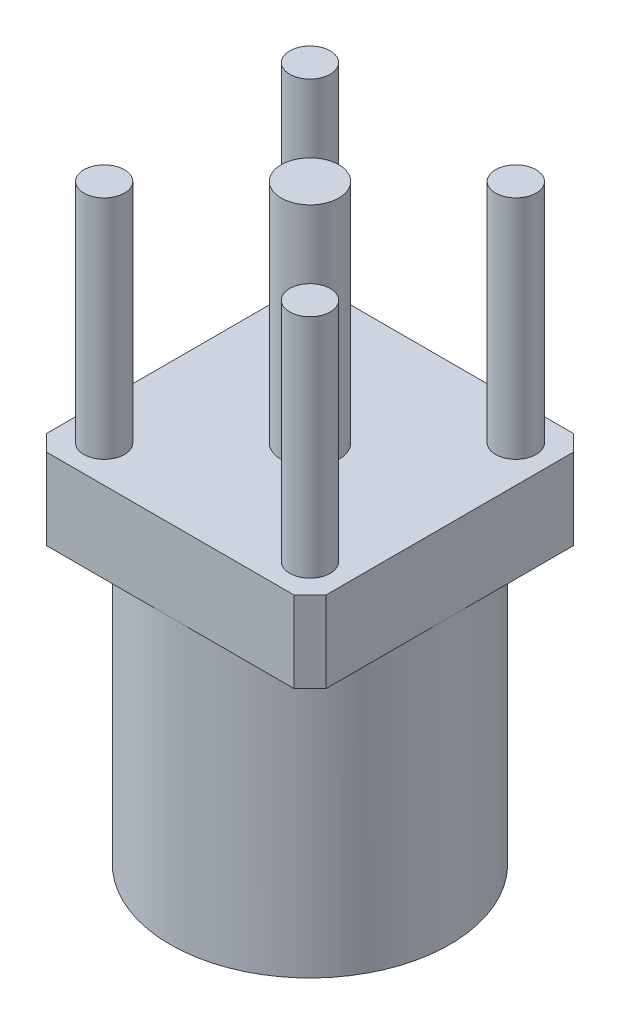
ISO-10303-21;
HEADER;
FILE_DESCRIPTION(('STEP AP214'),'2;1');
FILE_NAME('part.step','',(''),(''),'','','');
FILE_SCHEMA(('AUTOMOTIVE_DESIGN { 1 0 10303 214 1 1 1 1 }'));
ENDSEC;
DATA;
#1=APPLICATION_CONTEXT('core data for automotive mechanical design processes');
#2=APPLICATION_PROTOCOL_DEFINITION('international standard','automotive_design',2000,#1);
#3=PRODUCT_CONTEXT('',#1,'mechanical');
#4=PRODUCT('Part','Part','',(#3));
#5=PRODUCT_RELATED_PRODUCT_CATEGORY('part','',(#4));
#6=PRODUCT_DEFINITION_FORMATION('','',#4);
#7=PRODUCT_DEFINITION_CONTEXT('part definition',#1,'design');
#8=PRODUCT_DEFINITION('design','',#6,#7);
#9=PRODUCT_DEFINITION_SHAPE('','',#8);
#10=(LENGTH_UNIT() NAMED_UNIT(*) SI_UNIT(.MILLI.,.METRE.));
#11=(NAMED_UNIT(*) PLANE_ANGLE_UNIT() SI_UNIT($,.RADIAN.));
#12=(NAMED_UNIT(*) SI_UNIT($,.STERADIAN.) SOLID_ANGLE_UNIT());
#13=UNCERTAINTY_MEASURE_WITH_UNIT(LENGTH_MEASURE(1.E-05),#10,'distance_accuracy_value','');
#14=(GEOMETRIC_REPRESENTATION_CONTEXT(3) GLOBAL_UNCERTAINTY_ASSIGNED_CONTEXT((#13)) GLOBAL_UNIT_ASSIGNED_CONTEXT((#10,
#11,#12)) REPRESENTATION_CONTEXT('',''));
#15=CARTESIAN_POINT('',(0.,0.,0.));
#16=DIRECTION('',(0.,0.,1.));
#17=DIRECTION('',(1.,0.,0.));
#18=AXIS2_PLACEMENT_3D('',#15,#16,#17);
#19=CARTESIAN_POINT('',(0.,-3.5,0.));
#20=DIRECTION('',(0.,1.,0.));
#21=DIRECTION('',(0.,0.,1.));
#22=AXIS2_PLACEMENT_3D('',#19,#20,#21);
#23=CYLINDRICAL_SURFACE('',#22,0.35);
#24=CARTESIAN_POINT('',(0.,0.,0.));
#25=DIRECTION('',(0.,1.,0.));
#26=DIRECTION('',(0.,0.,1.));
#27=AXIS2_PLACEMENT_3D('',#24,#25,#26);
#28=CIRCLE('',#27,0.35);
#29=CARTESIAN_POINT('',(0.,0.,0.35));
#30=VERTEX_POINT('',#29);
#31=EDGE_CURVE('E14',#30,#30,#28,.F.);
#32=ORIENTED_EDGE('',*,*,#31,.T.);
#33=EDGE_LOOP('',(#32));
#34=FACE_BOUND('',#33,.T.);
#35=CARTESIAN_POINT('',(0.,-2.484,0.));
#36=DIRECTION('',(0.,-1.,0.));
#37=DIRECTION('',(0.,0.,-1.));
#38=AXIS2_PLACEMENT_3D('',#35,#36,#37);
#39=CIRCLE('',#38,0.35);
#40=CARTESIAN_POINT('',(0.,-2.484,-0.35));
#41=VERTEX_POINT('',#40);
#42=EDGE_CURVE('E263',#41,#41,#39,.T.);
#43=ORIENTED_EDGE('',*,*,#42,.F.);
#44=EDGE_LOOP('',(#43));
#45=FACE_BOUND('',#44,.T.);
#46=ADVANCED_FACE('F52',(#34,#45),#23,.T.);
#47=CARTESIAN_POINT('',(0.,1.,0.));
#48=DIRECTION('',(0.,1.,0.));
#49=DIRECTION('',(0.,0.,1.));
#50=AXIS2_PLACEMENT_3D('',#47,#48,#49);
#51=PLANE('',#50);
#52=CARTESIAN_POINT('',(1.27,1.,1.27));
#53=DIRECTION('',(0.,1.,0.));
#54=DIRECTION('',(0.,0.,1.));
#55=AXIS2_PLACEMENT_3D('',#52,#53,#54);
#56=CIRCLE('',#55,0.25);
#57=CARTESIAN_POINT('',(1.27,1.,1.52));
#58=VERTEX_POINT('',#57);
#59=EDGE_CURVE('E254',#58,#58,#56,.T.);
#60=ORIENTED_EDGE('',*,*,#59,.F.);
#61=EDGE_LOOP('',(#60));
#62=FACE_BOUND('',#61,.T.);
#63=CARTESIAN_POINT('',(-1.27,1.,1.27));
#64=DIRECTION('',(0.,1.,0.));
#65=DIRECTION('',(0.,0.,1.));
#66=AXIS2_PLACEMENT_3D('',#63,#64,#65);
#67=CIRCLE('',#66,0.25);
#68=CARTESIAN_POINT('',(-1.27,1.,1.52));
#69=VERTEX_POINT('',#68);
#70=EDGE_CURVE('E242',#69,#69,#67,.T.);
#71=ORIENTED_EDGE('',*,*,#70,.F.);
#72=EDGE_LOOP('',(#71));
#73=FACE_BOUND('',#72,.T.);
#74=DIRECTION('',(1.,0.,0.));
#75=VECTOR('',#74,1.);
#76=CARTESIAN_POINT('',(-1.525,1.,1.725));
#77=LINE('',#76,#75);
#78=CARTESIAN_POINT('',(-1.525,1.,1.725));
#79=VERTEX_POINT('',#78);
#80=CARTESIAN_POINT('',(1.525,1.,1.725));
#81=VERTEX_POINT('',#80);
#82=EDGE_CURVE('E166',#79,#81,#77,.T.);
#83=ORIENTED_EDGE('',*,*,#82,.T.);
#84=DIRECTION('',(0.707106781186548,0.,-0.707106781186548));
#85=VECTOR('',#84,1.);
#86=CARTESIAN_POINT('',(1.525,1.,1.725));
#87=LINE('',#86,#85);
#88=CARTESIAN_POINT('',(1.725,1.,1.525));
#89=VERTEX_POINT('',#88);
#90=EDGE_CURVE('E169',#81,#89,#87,.T.);
#91=ORIENTED_EDGE('',*,*,#90,.T.);
#92=DIRECTION('',(0.,0.,-1.));
#93=VECTOR('',#92,1.);
#94=CARTESIAN_POINT('',(1.725,1.,1.525));
#95=LINE('',#94,#93);
#96=CARTESIAN_POINT('',(1.725,1.,-1.525));
#97=VERTEX_POINT('',#96);
#98=EDGE_CURVE('E172',#89,#97,#95,.T.);
#99=ORIENTED_EDGE('',*,*,#98,.T.);
#100=DIRECTION('',(-0.707106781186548,0.,-0.707106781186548));
#101=VECTOR('',#100,1.);
#102=CARTESIAN_POINT('',(1.525,1.,-1.725));
#103=LINE('',#102,#101);
#104=CARTESIAN_POINT('',(1.525,1.,-1.725));
#105=VERTEX_POINT('',#104);
#106=EDGE_CURVE('E174',#97,#105,#103,.T.);
#107=ORIENTED_EDGE('',*,*,#106,.T.);
#108=DIRECTION('',(-1.,0.,0.));
#109=VECTOR('',#108,1.);
#110=CARTESIAN_POINT('',(-1.525,1.,-1.725));
#111=LINE('',#110,#109);
#112=CARTESIAN_POINT('',(-1.525,1.,-1.725));
#113=VERTEX_POINT('',#112);
#114=EDGE_CURVE('E176',#105,#113,#111,.T.);
#115=ORIENTED_EDGE('',*,*,#114,.T.);
#116=DIRECTION('',(-0.707106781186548,0.,0.707106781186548));
#117=VECTOR('',#116,1.);
#118=CARTESIAN_POINT('',(-1.725,1.,-1.525));
#119=LINE('',#118,#117);
#120=CARTESIAN_POINT('',(-1.725,1.,-1.525));
#121=VERTEX_POINT('',#120);
#122=EDGE_CURVE('E178',#113,#121,#119,.T.);
#123=ORIENTED_EDGE('',*,*,#122,.T.);
#124=DIRECTION('',(0.,0.,1.));
#125=VECTOR('',#124,1.);
#126=CARTESIAN_POINT('',(-1.725,1.,1.525));
#127=LINE('',#126,#125);
#128=CARTESIAN_POINT('',(-1.725,1.,1.525));
#129=VERTEX_POINT('',#128);
#130=EDGE_CURVE('E180',#121,#129,#127,.T.);
#131=ORIENTED_EDGE('',*,*,#130,.T.);
#132=DIRECTION('',(0.707106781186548,0.,0.707106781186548));
#133=VECTOR('',#132,1.);
#134=CARTESIAN_POINT('',(-1.725,1.,1.525));
#135=LINE('',#134,#133);
#136=EDGE_CURVE('E182',#129,#79,#135,.T.);
#137=ORIENTED_EDGE('',*,*,#136,.T.);
#138=EDGE_LOOP('',(#83,#91,#99,#107,#115,#123,#131,#137));
#139=FACE_BOUND('',#138,.T.);
#140=CARTESIAN_POINT('',(-1.27,1.,-1.27));
#141=DIRECTION('',(0.,1.,0.));
#142=DIRECTION('',(0.,0.,1.));
#143=AXIS2_PLACEMENT_3D('',#140,#141,#142);
#144=CIRCLE('',#143,0.25);
#145=CARTESIAN_POINT('',(-1.27,1.,-1.02));
#146=VERTEX_POINT('',#145);
#147=EDGE_CURVE('E235',#146,#146,#144,.T.);
#148=ORIENTED_EDGE('',*,*,#147,.F.);
#149=EDGE_LOOP('',(#148));
#150=FACE_BOUND('',#149,.T.);
#151=CARTESIAN_POINT('',(1.27,1.,-1.27));
#152=DIRECTION('',(0.,1.,0.));
#153=DIRECTION('',(0.,0.,1.));
#154=AXIS2_PLACEMENT_3D('',#151,#152,#153);
#155=CIRCLE('',#154,0.25);
#156=CARTESIAN_POINT('',(1.27,1.,-1.02));
#157=VERTEX_POINT('',#156);
#158=EDGE_CURVE('E248',#157,#157,#155,.T.);
#159=ORIENTED_EDGE('',*,*,#158,.F.);
#160=EDGE_LOOP('',(#159));
#161=FACE_BOUND('',#160,.T.);
#162=CARTESIAN_POINT('',(0.,1.,0.));
#163=DIRECTION('',(0.,1.,0.));
#164=DIRECTION('',(0.,0.,1.));
#165=AXIS2_PLACEMENT_3D('',#162,#163,#164);
#166=CIRCLE('',#165,0.3556);
#167=CARTESIAN_POINT('',(0.,1.,0.3556));
#168=VERTEX_POINT('',#167);
#169=EDGE_CURVE('E260',#168,#168,#166,.T.);
#170=ORIENTED_EDGE('',*,*,#169,.F.);
#171=EDGE_LOOP('',(#170));
#172=FACE_BOUND('',#171,.T.);
#173=ADVANCED_FACE('F272',(#62,#73,#139,#150,#161,#172),#51,.T.);
#174=CARTESIAN_POINT('',(0.,0.,0.));
#175=DIRECTION('',(0.,1.,0.));
#176=DIRECTION('',(0.,0.,1.));
#177=AXIS2_PLACEMENT_3D('',#174,#175,#176);
#178=PLANE('',#177);
#179=CARTESIAN_POINT('',(0.,0.,0.));
#180=DIRECTION('',(0.,-1.,0.));
#181=DIRECTION('',(0.,0.,-1.));
#182=AXIS2_PLACEMENT_3D('',#179,#180,#181);
#183=CIRCLE('',#182,1.37499999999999);
#184=CARTESIAN_POINT('',(0.,0.,-1.37499999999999));
#185=VERTEX_POINT('',#184);
#186=EDGE_CURVE('E155',#185,#185,#183,.T.);
#187=ORIENTED_EDGE('',*,*,#186,.T.);
#188=EDGE_LOOP('',(#187));
#189=FACE_BOUND('',#188,.T.);
#190=ORIENTED_EDGE('',*,*,#31,.F.);
#191=EDGE_LOOP('',(#190));
#192=FACE_BOUND('',#191,.T.);
#193=ADVANCED_FACE('F278',(#189,#192),#178,.F.);
#194=CARTESIAN_POINT('',(0.,0.,0.));
#195=DIRECTION('',(0.,-1.,0.));
#196=DIRECTION('',(0.,0.,-1.));
#197=AXIS2_PLACEMENT_3D('',#194,#195,#196);
#198=CIRCLE('',#197,1.725);
#199=CARTESIAN_POINT('',(0.,0.,-1.725));
#200=VERTEX_POINT('',#199);
#201=CARTESIAN_POINT('',(1.725,0.,0.));
#202=VERTEX_POINT('',#201);
#203=EDGE_CURVE('E149',#200,#202,#198,.T.);
#204=ORIENTED_EDGE('',*,*,#203,.F.);
#205=DIRECTION('',(-1.,0.,0.));
#206=VECTOR('',#205,1.);
#207=CARTESIAN_POINT('',(-1.525,0.,-1.725));
#208=LINE('',#207,#206);
#209=CARTESIAN_POINT('',(1.525,0.,-1.725));
#210=VERTEX_POINT('',#209);
#211=EDGE_CURVE('E132',#210,#200,#208,.T.);
#212=ORIENTED_EDGE('',*,*,#211,.F.);
#213=DIRECTION('',(-0.707106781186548,0.,-0.707106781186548));
#214=VECTOR('',#213,1.);
#215=CARTESIAN_POINT('',(1.525,0.,-1.725));
#216=LINE('',#215,#214);
#217=CARTESIAN_POINT('',(1.725,0.,-1.525));
#218=VERTEX_POINT('',#217);
#219=EDGE_CURVE('E147',#218,#210,#216,.T.);
#220=ORIENTED_EDGE('',*,*,#219,.F.);
#221=DIRECTION('',(0.,0.,-1.));
#222=VECTOR('',#221,1.);
#223=CARTESIAN_POINT('',(1.725,0.,1.525));
#224=LINE('',#223,#222);
#225=EDGE_CURVE('E151',#202,#218,#224,.T.);
#226=ORIENTED_EDGE('',*,*,#225,.F.);
#227=EDGE_LOOP('',(#204,#212,#220,#226));
#228=FACE_BOUND('',#227,.T.);
#229=ADVANCED_FACE('F150',(#228),#178,.F.);
#230=CARTESIAN_POINT('',(0.,0.,1.725));
#231=VERTEX_POINT('',#230);
#232=EDGE_CURVE('E60',#202,#231,#198,.T.);
#233=ORIENTED_EDGE('',*,*,#232,.F.);
#234=CARTESIAN_POINT('',(1.725,0.,1.525));
#235=VERTEX_POINT('',#234);
#236=EDGE_CURVE('E191',#235,#202,#224,.T.);
#237=ORIENTED_EDGE('',*,*,#236,.F.);
#238=DIRECTION('',(0.707106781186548,0.,-0.707106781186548));
#239=VECTOR('',#238,1.);
#240=CARTESIAN_POINT('',(1.525,0.,1.725));
#241=LINE('',#240,#239);
#242=CARTESIAN_POINT('',(1.525,0.,1.725));
#243=VERTEX_POINT('',#242);
#244=EDGE_CURVE('E188',#243,#235,#241,.T.);
#245=ORIENTED_EDGE('',*,*,#244,.F.);
#246=DIRECTION('',(1.,0.,0.));
#247=VECTOR('',#246,1.);
#248=CARTESIAN_POINT('',(-1.525,0.,1.725));
#249=LINE('',#248,#247);
#250=EDGE_CURVE('E189',#231,#243,#249,.T.);
#251=ORIENTED_EDGE('',*,*,#250,.F.);
#252=EDGE_LOOP('',(#233,#237,#245,#251));
#253=FACE_BOUND('',#252,.T.);
#254=ADVANCED_FACE('F222',(#253),#178,.F.);
#255=CARTESIAN_POINT('',(-1.725,0.,0.));
#256=VERTEX_POINT('',#255);
#257=EDGE_CURVE('E159',#231,#256,#198,.T.);
#258=ORIENTED_EDGE('',*,*,#257,.F.);
#259=CARTESIAN_POINT('',(-1.525,0.,1.725));
#260=VERTEX_POINT('',#259);
#261=EDGE_CURVE('E185',#260,#231,#249,.T.);
#262=ORIENTED_EDGE('',*,*,#261,.F.);
#263=DIRECTION('',(0.707106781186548,0.,0.707106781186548));
#264=VECTOR('',#263,1.);
#265=CARTESIAN_POINT('',(-1.725,0.,1.525));
#266=LINE('',#265,#264);
#267=CARTESIAN_POINT('',(-1.725,0.,1.525));
#268=VERTEX_POINT('',#267);
#269=EDGE_CURVE('E170',#268,#260,#266,.T.);
#270=ORIENTED_EDGE('',*,*,#269,.F.);
#271=DIRECTION('',(0.,0.,1.));
#272=VECTOR('',#271,1.);
#273=CARTESIAN_POINT('',(-1.725,0.,1.525));
#274=LINE('',#273,#272);
#275=EDGE_CURVE('E195',#256,#268,#274,.T.);
#276=ORIENTED_EDGE('',*,*,#275,.F.);
#277=EDGE_LOOP('',(#258,#262,#270,#276));
#278=FACE_BOUND('',#277,.T.);
#279=ADVANCED_FACE('F325',(#278),#178,.F.);
#280=EDGE_CURVE('E74',#256,#200,#198,.T.);
#281=ORIENTED_EDGE('',*,*,#280,.F.);
#282=CARTESIAN_POINT('',(-1.725,0.,-1.525));
#283=VERTEX_POINT('',#282);
#284=EDGE_CURVE('E196',#283,#256,#274,.T.);
#285=ORIENTED_EDGE('',*,*,#284,.F.);
#286=DIRECTION('',(-0.707106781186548,0.,0.707106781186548));
#287=VECTOR('',#286,1.);
#288=CARTESIAN_POINT('',(-1.725,0.,-1.525));
#289=LINE('',#288,#287);
#290=CARTESIAN_POINT('',(-1.525,0.,-1.725));
#291=VERTEX_POINT('',#290);
#292=EDGE_CURVE('E143',#291,#283,#289,.T.);
#293=ORIENTED_EDGE('',*,*,#292,.F.);
#294=EDGE_CURVE('E135',#200,#291,#208,.T.);
#295=ORIENTED_EDGE('',*,*,#294,.F.);
#296=EDGE_LOOP('',(#281,#285,#293,#295));
#297=FACE_BOUND('',#296,.T.);
#298=ADVANCED_FACE('F146',(#297),#178,.F.);
#299=CARTESIAN_POINT('',(-1.525,1.,1.725));
#300=DIRECTION('',(0.,0.,-1.));
#301=DIRECTION('',(-1.,0.,0.));
#302=AXIS2_PLACEMENT_3D('',#299,#300,#301);
#303=PLANE('',#302);
#304=ORIENTED_EDGE('',*,*,#261,.T.);
#305=ORIENTED_EDGE('',*,*,#250,.T.);
#306=DIRECTION('',(0.,-1.,0.));
#307=VECTOR('',#306,1.);
#308=CARTESIAN_POINT('',(1.525,1.,1.725));
#309=LINE('',#308,#307);
#310=EDGE_CURVE('E160',#81,#243,#309,.T.);
#311=ORIENTED_EDGE('',*,*,#310,.F.);
#312=ORIENTED_EDGE('',*,*,#82,.F.);
#313=DIRECTION('',(0.,-1.,0.));
#314=VECTOR('',#313,1.);
#315=CARTESIAN_POINT('',(-1.525,1.,1.725));
#316=LINE('',#315,#314);
#317=EDGE_CURVE('E184',#79,#260,#316,.T.);
#318=ORIENTED_EDGE('',*,*,#317,.T.);
#319=EDGE_LOOP('',(#304,#305,#311,#312,#318));
#320=FACE_BOUND('',#319,.T.);
#321=ADVANCED_FACE('F54',(#320),#303,.F.);
#322=CARTESIAN_POINT('',(1.525,1.,1.725));
#323=DIRECTION('',(-0.707106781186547,0.,-0.707106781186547));
#324=DIRECTION('',(-0.707106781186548,0.,0.707106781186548));
#325=AXIS2_PLACEMENT_3D('',#322,#323,#324);
#326=PLANE('',#325);
#327=ORIENTED_EDGE('',*,*,#244,.T.);
#328=DIRECTION('',(0.,-1.,0.));
#329=VECTOR('',#328,1.);
#330=CARTESIAN_POINT('',(1.725,1.,1.525));
#331=LINE('',#330,#329);
#332=EDGE_CURVE('E162',#89,#235,#331,.T.);
#333=ORIENTED_EDGE('',*,*,#332,.F.);
#334=ORIENTED_EDGE('',*,*,#90,.F.);
#335=ORIENTED_EDGE('',*,*,#310,.T.);
#336=EDGE_LOOP('',(#327,#333,#334,#335));
#337=FACE_BOUND('',#336,.T.);
#338=ADVANCED_FACE('F224',(#337),#326,.F.);
#339=CARTESIAN_POINT('',(1.725,1.,1.525));
#340=DIRECTION('',(-1.,0.,0.));
#341=DIRECTION('',(0.,0.,1.));
#342=AXIS2_PLACEMENT_3D('',#339,#340,#341);
#343=PLANE('',#342);
#344=ORIENTED_EDGE('',*,*,#236,.T.);
#345=ORIENTED_EDGE('',*,*,#225,.T.);
#346=DIRECTION('',(0.,-1.,0.));
#347=VECTOR('',#346,1.);
#348=CARTESIAN_POINT('',(1.725,1.,-1.525));
#349=LINE('',#348,#347);
#350=EDGE_CURVE('E211',#97,#218,#349,.T.);
#351=ORIENTED_EDGE('',*,*,#350,.F.);
#352=ORIENTED_EDGE('',*,*,#98,.F.);
#353=ORIENTED_EDGE('',*,*,#332,.T.);
#354=EDGE_LOOP('',(#344,#345,#351,#352,#353));
#355=FACE_BOUND('',#354,.T.);
#356=ADVANCED_FACE('F218',(#355),#343,.F.);
#357=CARTESIAN_POINT('',(1.525,1.,-1.725));
#358=DIRECTION('',(-0.707106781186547,0.,0.707106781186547));
#359=DIRECTION('',(0.707106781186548,0.,0.707106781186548));
#360=AXIS2_PLACEMENT_3D('',#357,#358,#359);
#361=PLANE('',#360);
#362=ORIENTED_EDGE('',*,*,#219,.T.);
#363=DIRECTION('',(0.,-1.,0.));
#364=VECTOR('',#363,1.);
#365=CARTESIAN_POINT('',(1.525,1.,-1.725));
#366=LINE('',#365,#364);
#367=EDGE_CURVE('E139',#105,#210,#366,.T.);
#368=ORIENTED_EDGE('',*,*,#367,.F.);
#369=ORIENTED_EDGE('',*,*,#106,.F.);
#370=ORIENTED_EDGE('',*,*,#350,.T.);
#371=EDGE_LOOP('',(#362,#368,#369,#370));
#372=FACE_BOUND('',#371,.T.);
#373=ADVANCED_FACE('F313',(#372),#361,.F.);
#374=CARTESIAN_POINT('',(-1.525,1.,-1.725));
#375=DIRECTION('',(0.,0.,1.));
#376=DIRECTION('',(1.,0.,0.));
#377=AXIS2_PLACEMENT_3D('',#374,#375,#376);
#378=PLANE('',#377);
#379=ORIENTED_EDGE('',*,*,#211,.T.);
#380=ORIENTED_EDGE('',*,*,#294,.T.);
#381=DIRECTION('',(0.,-1.,0.));
#382=VECTOR('',#381,1.);
#383=CARTESIAN_POINT('',(-1.525,1.,-1.725));
#384=LINE('',#383,#382);
#385=EDGE_CURVE('E208',#113,#291,#384,.T.);
#386=ORIENTED_EDGE('',*,*,#385,.F.);
#387=ORIENTED_EDGE('',*,*,#114,.F.);
#388=ORIENTED_EDGE('',*,*,#367,.T.);
#389=EDGE_LOOP('',(#379,#380,#386,#387,#388));
#390=FACE_BOUND('',#389,.T.);
#391=ADVANCED_FACE('F133',(#390),#378,.F.);
#392=CARTESIAN_POINT('',(-1.725,1.,-1.525));
#393=DIRECTION('',(0.707106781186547,0.,0.707106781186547));
#394=DIRECTION('',(0.707106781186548,0.,-0.707106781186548));
#395=AXIS2_PLACEMENT_3D('',#392,#393,#394);
#396=PLANE('',#395);
#397=ORIENTED_EDGE('',*,*,#292,.T.);
#398=DIRECTION('',(0.,-1.,0.));
#399=VECTOR('',#398,1.);
#400=CARTESIAN_POINT('',(-1.725,1.,-1.525));
#401=LINE('',#400,#399);
#402=EDGE_CURVE('E205',#121,#283,#401,.T.);
#403=ORIENTED_EDGE('',*,*,#402,.F.);
#404=ORIENTED_EDGE('',*,*,#122,.F.);
#405=ORIENTED_EDGE('',*,*,#385,.T.);
#406=EDGE_LOOP('',(#397,#403,#404,#405));
#407=FACE_BOUND('',#406,.T.);
#408=ADVANCED_FACE('F306',(#407),#396,.F.);
#409=CARTESIAN_POINT('',(-1.725,1.,1.525));
#410=DIRECTION('',(1.,0.,0.));
#411=DIRECTION('',(0.,0.,-1.));
#412=AXIS2_PLACEMENT_3D('',#409,#410,#411);
#413=PLANE('',#412);
#414=ORIENTED_EDGE('',*,*,#284,.T.);
#415=ORIENTED_EDGE('',*,*,#275,.T.);
#416=DIRECTION('',(0.,-1.,0.));
#417=VECTOR('',#416,1.);
#418=CARTESIAN_POINT('',(-1.725,1.,1.525));
#419=LINE('',#418,#417);
#420=EDGE_CURVE('E202',#129,#268,#419,.T.);
#421=ORIENTED_EDGE('',*,*,#420,.F.);
#422=ORIENTED_EDGE('',*,*,#130,.F.);
#423=ORIENTED_EDGE('',*,*,#402,.T.);
#424=EDGE_LOOP('',(#414,#415,#421,#422,#423));
#425=FACE_BOUND('',#424,.T.);
#426=ADVANCED_FACE('F302',(#425),#413,.F.);
#427=CARTESIAN_POINT('',(-1.725,1.,1.525));
#428=DIRECTION('',(0.707106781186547,0.,-0.707106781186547));
#429=DIRECTION('',(-0.707106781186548,0.,-0.707106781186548));
#430=AXIS2_PLACEMENT_3D('',#427,#428,#429);
#431=PLANE('',#430);
#432=ORIENTED_EDGE('',*,*,#269,.T.);
#433=ORIENTED_EDGE('',*,*,#317,.F.);
#434=ORIENTED_EDGE('',*,*,#136,.F.);
#435=ORIENTED_EDGE('',*,*,#420,.T.);
#436=EDGE_LOOP('',(#432,#433,#434,#435));
#437=FACE_BOUND('',#436,.T.);
#438=ADVANCED_FACE('F294',(#437),#431,.F.);
#439=CARTESIAN_POINT('',(0.,-3.5,0.));
#440=DIRECTION('',(0.,1.,0.));
#441=DIRECTION('',(0.,0.,1.));
#442=AXIS2_PLACEMENT_3D('',#439,#440,#441);
#443=CYLINDRICAL_SURFACE('',#442,1.37499999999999);
#444=CARTESIAN_POINT('',(0.,-3.5,0.));
#445=DIRECTION('',(0.,-1.,0.));
#446=DIRECTION('',(0.,0.,-1.));
#447=AXIS2_PLACEMENT_3D('',#444,#445,#446);
#448=CIRCLE('',#447,1.37499999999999);
#449=CARTESIAN_POINT('',(0.,-3.5,-1.37499999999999));
#450=VERTEX_POINT('',#449);
#451=EDGE_CURVE('E154',#450,#450,#448,.T.);
#452=ORIENTED_EDGE('',*,*,#451,.T.);
#453=EDGE_LOOP('',(#452));
#454=FACE_BOUND('',#453,.T.);
#455=ORIENTED_EDGE('',*,*,#186,.F.);
#456=EDGE_LOOP('',(#455));
#457=FACE_BOUND('',#456,.T.);
#458=ADVANCED_FACE('F291',(#454,#457),#443,.F.);
#459=CARTESIAN_POINT('',(0.,-3.5,0.));
#460=DIRECTION('',(0.,1.,0.));
#461=DIRECTION('',(0.,0.,1.));
#462=AXIS2_PLACEMENT_3D('',#459,#460,#461);
#463=CYLINDRICAL_SURFACE('',#462,1.725);
#464=CARTESIAN_POINT('',(0.,-3.5,0.));
#465=DIRECTION('',(0.,-1.,0.));
#466=DIRECTION('',(0.,0.,-1.));
#467=AXIS2_PLACEMENT_3D('',#464,#465,#466);
#468=CIRCLE('',#467,1.725);
#469=CARTESIAN_POINT('',(0.,-3.5,-1.725));
#470=VERTEX_POINT('',#469);
#471=EDGE_CURVE('E228',#470,#470,#468,.T.);
#472=ORIENTED_EDGE('',*,*,#471,.F.);
#473=EDGE_LOOP('',(#472));
#474=FACE_BOUND('',#473,.T.);
#475=ORIENTED_EDGE('',*,*,#203,.T.);
#476=ORIENTED_EDGE('',*,*,#232,.T.);
#477=ORIENTED_EDGE('',*,*,#257,.T.);
#478=ORIENTED_EDGE('',*,*,#280,.T.);
#479=EDGE_LOOP('',(#475,#476,#477,#478));
#480=FACE_BOUND('',#479,.T.);
#481=ADVANCED_FACE('F158',(#474,#480),#463,.T.);
#482=CARTESIAN_POINT('',(0.,-3.5,0.));
#483=DIRECTION('',(0.,-1.,0.));
#484=DIRECTION('',(0.,0.,-1.));
#485=AXIS2_PLACEMENT_3D('',#482,#483,#484);
#486=PLANE('',#485);
#487=ORIENTED_EDGE('',*,*,#451,.F.);
#488=EDGE_LOOP('',(#487));
#489=FACE_BOUND('',#488,.T.);
#490=ORIENTED_EDGE('',*,*,#471,.T.);
#491=EDGE_LOOP('',(#490));
#492=FACE_BOUND('',#491,.T.);
#493=ADVANCED_FACE('F285',(#489,#492),#486,.T.);
#494=CARTESIAN_POINT('',(-1.27,3.794,-1.27));
#495=DIRECTION('',(0.,-1.,0.));
#496=DIRECTION('',(0.,0.,-1.));
#497=AXIS2_PLACEMENT_3D('',#494,#495,#496);
#498=CYLINDRICAL_SURFACE('',#497,0.25);
#499=CARTESIAN_POINT('',(-1.27,3.794,-1.27));
#500=DIRECTION('',(0.,1.,0.));
#501=DIRECTION('',(0.,0.,1.));
#502=AXIS2_PLACEMENT_3D('',#499,#500,#501);
#503=CIRCLE('',#502,0.25);
#504=CARTESIAN_POINT('',(-1.27,3.794,-1.02));
#505=VERTEX_POINT('',#504);
#506=EDGE_CURVE('E238',#505,#505,#503,.T.);
#507=ORIENTED_EDGE('',*,*,#506,.F.);
#508=EDGE_LOOP('',(#507));
#509=FACE_BOUND('',#508,.T.);
#510=ORIENTED_EDGE('',*,*,#147,.T.);
#511=EDGE_LOOP('',(#510));
#512=FACE_BOUND('',#511,.T.);
#513=ADVANCED_FACE('F283',(#509,#512),#498,.T.);
#514=CARTESIAN_POINT('',(-1.27,3.794,-1.27));
#515=DIRECTION('',(0.,1.,0.));
#516=DIRECTION('',(0.,0.,1.));
#517=AXIS2_PLACEMENT_3D('',#514,#515,#516);
#518=PLANE('',#517);
#519=ORIENTED_EDGE('',*,*,#506,.T.);
#520=EDGE_LOOP('',(#519));
#521=FACE_BOUND('',#520,.T.);
#522=ADVANCED_FACE('F384',(#521),#518,.T.);
#523=CARTESIAN_POINT('',(-1.27,3.794,1.27));
#524=DIRECTION('',(0.,-1.,0.));
#525=DIRECTION('',(0.,0.,-1.));
#526=AXIS2_PLACEMENT_3D('',#523,#524,#525);
#527=CYLINDRICAL_SURFACE('',#526,0.25);
#528=CARTESIAN_POINT('',(-1.27,3.794,1.27));
#529=DIRECTION('',(0.,1.,0.));
#530=DIRECTION('',(0.,0.,1.));
#531=AXIS2_PLACEMENT_3D('',#528,#529,#530);
#532=CIRCLE('',#531,0.25);
#533=CARTESIAN_POINT('',(-1.27,3.794,1.52));
#534=VERTEX_POINT('',#533);
#535=EDGE_CURVE('E239',#534,#534,#532,.T.);
#536=ORIENTED_EDGE('',*,*,#535,.F.);
#537=EDGE_LOOP('',(#536));
#538=FACE_BOUND('',#537,.T.);
#539=ORIENTED_EDGE('',*,*,#70,.T.);
#540=EDGE_LOOP('',(#539));
#541=FACE_BOUND('',#540,.T.);
#542=ADVANCED_FACE('F381',(#538,#541),#527,.T.);
#543=CARTESIAN_POINT('',(-1.27,3.794,1.27));
#544=DIRECTION('',(0.,1.,0.));
#545=DIRECTION('',(0.,0.,1.));
#546=AXIS2_PLACEMENT_3D('',#543,#544,#545);
#547=PLANE('',#546);
#548=ORIENTED_EDGE('',*,*,#535,.T.);
#549=EDGE_LOOP('',(#548));
#550=FACE_BOUND('',#549,.T.);
#551=ADVANCED_FACE('F377',(#550),#547,.T.);
#552=CARTESIAN_POINT('',(1.27,3.794,-1.27));
#553=DIRECTION('',(0.,-1.,0.));
#554=DIRECTION('',(0.,0.,-1.));
#555=AXIS2_PLACEMENT_3D('',#552,#553,#554);
#556=CYLINDRICAL_SURFACE('',#555,0.25);
#557=CARTESIAN_POINT('',(1.27,3.794,-1.27));
#558=DIRECTION('',(0.,1.,0.));
#559=DIRECTION('',(0.,0.,1.));
#560=AXIS2_PLACEMENT_3D('',#557,#558,#559);
#561=CIRCLE('',#560,0.25);
#562=CARTESIAN_POINT('',(1.27,3.794,-1.02));
#563=VERTEX_POINT('',#562);
#564=EDGE_CURVE('E245',#563,#563,#561,.T.);
#565=ORIENTED_EDGE('',*,*,#564,.F.);
#566=EDGE_LOOP('',(#565));
#567=FACE_BOUND('',#566,.T.);
#568=ORIENTED_EDGE('',*,*,#158,.T.);
#569=EDGE_LOOP('',(#568));
#570=FACE_BOUND('',#569,.T.);
#571=ADVANCED_FACE('F373',(#567,#570),#556,.T.);
#572=CARTESIAN_POINT('',(1.27,3.794,-1.27));
#573=DIRECTION('',(0.,1.,0.));
#574=DIRECTION('',(0.,0.,1.));
#575=AXIS2_PLACEMENT_3D('',#572,#573,#574);
#576=PLANE('',#575);
#577=ORIENTED_EDGE('',*,*,#564,.T.);
#578=EDGE_LOOP('',(#577));
#579=FACE_BOUND('',#578,.T.);
#580=ADVANCED_FACE('F369',(#579),#576,.T.);
#581=CARTESIAN_POINT('',(1.27,3.794,1.27));
#582=DIRECTION('',(0.,-1.,0.));
#583=DIRECTION('',(0.,0.,-1.));
#584=AXIS2_PLACEMENT_3D('',#581,#582,#583);
#585=CYLINDRICAL_SURFACE('',#584,0.25);
#586=CARTESIAN_POINT('',(1.27,3.794,1.27));
#587=DIRECTION('',(0.,1.,0.));
#588=DIRECTION('',(0.,0.,1.));
#589=AXIS2_PLACEMENT_3D('',#586,#587,#588);
#590=CIRCLE('',#589,0.25);
#591=CARTESIAN_POINT('',(1.27,3.794,1.52));
#592=VERTEX_POINT('',#591);
#593=EDGE_CURVE('E251',#592,#592,#590,.T.);
#594=ORIENTED_EDGE('',*,*,#593,.F.);
#595=EDGE_LOOP('',(#594));
#596=FACE_BOUND('',#595,.T.);
#597=ORIENTED_EDGE('',*,*,#59,.T.);
#598=EDGE_LOOP('',(#597));
#599=FACE_BOUND('',#598,.T.);
#600=ADVANCED_FACE('F361',(#596,#599),#585,.T.);
#601=CARTESIAN_POINT('',(1.27,3.794,1.27));
#602=DIRECTION('',(0.,1.,0.));
#603=DIRECTION('',(0.,0.,1.));
#604=AXIS2_PLACEMENT_3D('',#601,#602,#603);
#605=PLANE('',#604);
#606=ORIENTED_EDGE('',*,*,#593,.T.);
#607=EDGE_LOOP('',(#606));
#608=FACE_BOUND('',#607,.T.);
#609=ADVANCED_FACE('F352',(#608),#605,.T.);
#610=CARTESIAN_POINT('',(0.,3.794,0.));
#611=DIRECTION('',(0.,-1.,0.));
#612=DIRECTION('',(0.,0.,-1.));
#613=AXIS2_PLACEMENT_3D('',#610,#611,#612);
#614=CYLINDRICAL_SURFACE('',#613,0.3556);
#615=CARTESIAN_POINT('',(0.,3.794,0.));
#616=DIRECTION('',(0.,1.,0.));
#617=DIRECTION('',(0.,0.,1.));
#618=AXIS2_PLACEMENT_3D('',#615,#616,#617);
#619=CIRCLE('',#618,0.3556);
#620=CARTESIAN_POINT('',(0.,3.794,0.3556));
#621=VERTEX_POINT('',#620);
#622=EDGE_CURVE('E257',#621,#621,#619,.T.);
#623=ORIENTED_EDGE('',*,*,#622,.F.);
#624=EDGE_LOOP('',(#623));
#625=FACE_BOUND('',#624,.T.);
#626=ORIENTED_EDGE('',*,*,#169,.T.);
#627=EDGE_LOOP('',(#626));
#628=FACE_BOUND('',#627,.T.);
#629=ADVANCED_FACE('F349',(#625,#628),#614,.T.);
#630=CARTESIAN_POINT('',(0.,3.794,0.));
#631=DIRECTION('',(0.,1.,0.));
#632=DIRECTION('',(0.,0.,1.));
#633=AXIS2_PLACEMENT_3D('',#630,#631,#632);
#634=PLANE('',#633);
#635=ORIENTED_EDGE('',*,*,#622,.T.);
#636=EDGE_LOOP('',(#635));
#637=FACE_BOUND('',#636,.T.);
#638=ADVANCED_FACE('F351',(#637),#634,.T.);
#639=CARTESIAN_POINT('',(0.,-2.484,0.));
#640=DIRECTION('',(0.,-1.,0.));
#641=DIRECTION('',(0.,0.,-1.));
#642=AXIS2_PLACEMENT_3D('',#639,#640,#641);
#643=PLANE('',#642);
#644=ORIENTED_EDGE('',*,*,#42,.T.);
#645=EDGE_LOOP('',(#644));
#646=FACE_BOUND('',#645,.T.);
#647=ADVANCED_FACE('F269',(#646),#643,.T.);
#648=CLOSED_SHELL('',(#46,#173,#193,#229,#254,#279,#298,#321,#338,#356,#373,#391,#408,#426,#438,
#458,#481,#493,#513,#522,#542,#551,#571,#580,#600,#609,#629,#638,#647));
#649=MANIFOLD_SOLID_BREP('B2',#648);
#650=ADVANCED_BREP_SHAPE_REPRESENTATION('',(#18,#649),#14);
#651=SHAPE_DEFINITION_REPRESENTATION(#9,#650);
ENDSEC;
END-ISO-10303-21;
